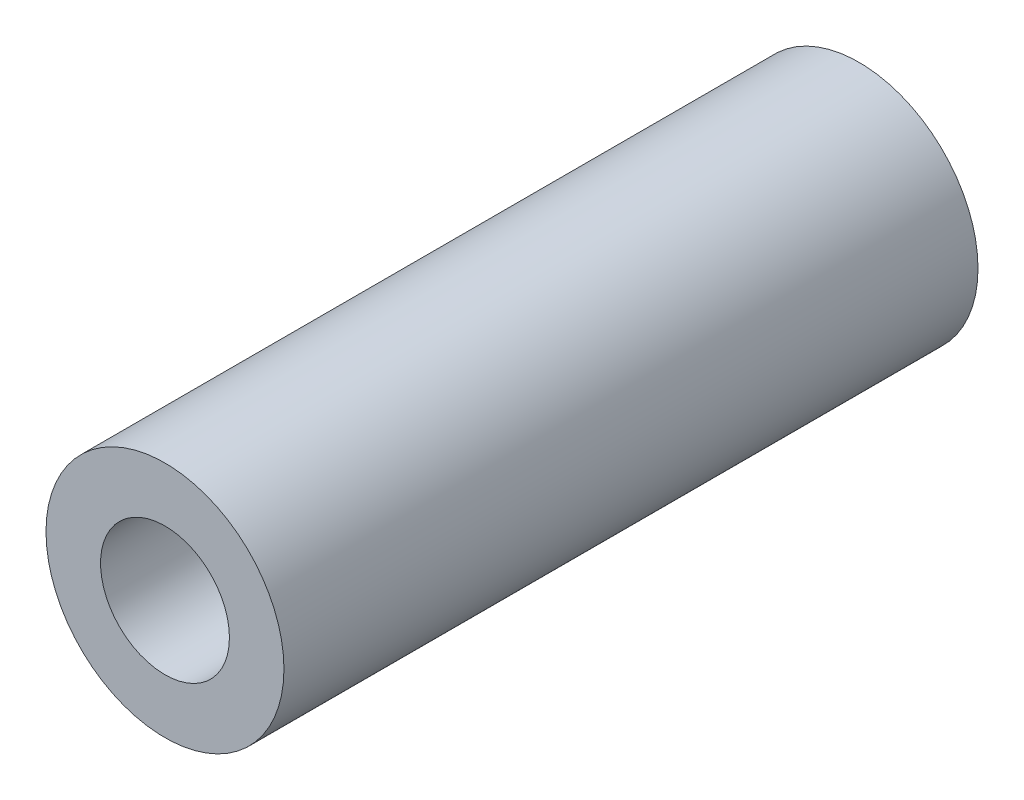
ISO-10303-21;
HEADER;
FILE_DESCRIPTION(('STEP AP214'),'2;1');
FILE_NAME('part.step','',(''),(''),'','','');
FILE_SCHEMA(('AUTOMOTIVE_DESIGN { 1 0 10303 214 1 1 1 1 }'));
ENDSEC;
DATA;
#1=APPLICATION_CONTEXT('core data for automotive mechanical design processes');
#2=APPLICATION_PROTOCOL_DEFINITION('international standard','automotive_design',2000,#1);
#3=PRODUCT_CONTEXT('',#1,'mechanical');
#4=PRODUCT('Part','Part','',(#3));
#5=PRODUCT_RELATED_PRODUCT_CATEGORY('part','',(#4));
#6=PRODUCT_DEFINITION_FORMATION('','',#4);
#7=PRODUCT_DEFINITION_CONTEXT('part definition',#1,'design');
#8=PRODUCT_DEFINITION('design','',#6,#7);
#9=PRODUCT_DEFINITION_SHAPE('','',#8);
#10=(LENGTH_UNIT() NAMED_UNIT(*) SI_UNIT(.MILLI.,.METRE.));
#11=(NAMED_UNIT(*) PLANE_ANGLE_UNIT() SI_UNIT($,.RADIAN.));
#12=(NAMED_UNIT(*) SI_UNIT($,.STERADIAN.) SOLID_ANGLE_UNIT());
#13=UNCERTAINTY_MEASURE_WITH_UNIT(LENGTH_MEASURE(1.E-05),#10,'distance_accuracy_value','');
#14=(GEOMETRIC_REPRESENTATION_CONTEXT(3) GLOBAL_UNCERTAINTY_ASSIGNED_CONTEXT((#13)) GLOBAL_UNIT_ASSIGNED_CONTEXT((#10,
#11,#12)) REPRESENTATION_CONTEXT('',''));
#15=CARTESIAN_POINT('',(0.,0.,0.));
#16=DIRECTION('',(0.,0.,1.));
#17=DIRECTION('',(1.,0.,0.));
#18=AXIS2_PLACEMENT_3D('',#15,#16,#17);
#19=CARTESIAN_POINT('',(0.,0.,35.));
#20=DIRECTION('',(0.,0.,1.));
#21=DIRECTION('',(1.,0.,0.));
#22=AXIS2_PLACEMENT_3D('',#19,#20,#21);
#23=PLANE('',#22);
#24=CARTESIAN_POINT('',(0.,0.,35.));
#25=DIRECTION('',(0.,0.,1.));
#26=DIRECTION('',(1.,0.,0.));
#27=AXIS2_PLACEMENT_3D('',#24,#25,#26);
#28=CIRCLE('',#27,6.);
#29=CARTESIAN_POINT('',(6.,0.,35.));
#30=VERTEX_POINT('',#29);
#31=EDGE_CURVE('E10',#30,#30,#28,.T.);
#32=ORIENTED_EDGE('',*,*,#31,.T.);
#33=EDGE_LOOP('',(#32));
#34=FACE_BOUND('',#33,.T.);
#35=CARTESIAN_POINT('',(0.,0.,35.));
#36=DIRECTION('',(0.,0.,1.));
#37=DIRECTION('',(1.,0.,0.));
#38=AXIS2_PLACEMENT_3D('',#35,#36,#37);
#39=CIRCLE('',#38,3.25);
#40=CARTESIAN_POINT('',(3.25,0.,35.));
#41=VERTEX_POINT('',#40);
#42=EDGE_CURVE('E39',#41,#41,#39,.T.);
#43=ORIENTED_EDGE('',*,*,#42,.F.);
#44=EDGE_LOOP('',(#43));
#45=FACE_BOUND('',#44,.T.);
#46=ADVANCED_FACE('F28',(#34,#45),#23,.T.);
#47=CARTESIAN_POINT('',(0.,0.,0.));
#48=DIRECTION('',(0.,0.,1.));
#49=DIRECTION('',(1.,0.,0.));
#50=AXIS2_PLACEMENT_3D('',#47,#48,#49);
#51=PLANE('',#50);
#52=CARTESIAN_POINT('',(0.,0.,0.));
#53=DIRECTION('',(0.,0.,1.));
#54=DIRECTION('',(1.,0.,0.));
#55=AXIS2_PLACEMENT_3D('',#52,#53,#54);
#56=CIRCLE('',#55,6.);
#57=CARTESIAN_POINT('',(6.,0.,0.));
#58=VERTEX_POINT('',#57);
#59=EDGE_CURVE('E35',#58,#58,#56,.T.);
#60=ORIENTED_EDGE('',*,*,#59,.F.);
#61=EDGE_LOOP('',(#60));
#62=FACE_BOUND('',#61,.T.);
#63=CARTESIAN_POINT('',(0.,0.,0.));
#64=DIRECTION('',(0.,0.,1.));
#65=DIRECTION('',(1.,0.,0.));
#66=AXIS2_PLACEMENT_3D('',#63,#64,#65);
#67=CIRCLE('',#66,3.25);
#68=CARTESIAN_POINT('',(3.25,0.,0.));
#69=VERTEX_POINT('',#68);
#70=EDGE_CURVE('E43',#69,#69,#67,.T.);
#71=ORIENTED_EDGE('',*,*,#70,.T.);
#72=EDGE_LOOP('',(#71));
#73=FACE_BOUND('',#72,.T.);
#74=ADVANCED_FACE('F49',(#62,#73),#51,.F.);
#75=CARTESIAN_POINT('',(0.,0.,35.));
#76=DIRECTION('',(0.,0.,-1.));
#77=DIRECTION('',(-1.,0.,0.));
#78=AXIS2_PLACEMENT_3D('',#75,#76,#77);
#79=CYLINDRICAL_SURFACE('',#78,6.);
#80=ORIENTED_EDGE('',*,*,#31,.F.);
#81=EDGE_LOOP('',(#80));
#82=FACE_BOUND('',#81,.T.);
#83=ORIENTED_EDGE('',*,*,#59,.T.);
#84=EDGE_LOOP('',(#83));
#85=FACE_BOUND('',#84,.T.);
#86=ADVANCED_FACE('F30',(#82,#85),#79,.T.);
#87=CARTESIAN_POINT('',(0.,0.,35.));
#88=DIRECTION('',(0.,0.,-1.));
#89=DIRECTION('',(-1.,0.,0.));
#90=AXIS2_PLACEMENT_3D('',#87,#88,#89);
#91=CYLINDRICAL_SURFACE('',#90,3.25);
#92=ORIENTED_EDGE('',*,*,#42,.T.);
#93=EDGE_LOOP('',(#92));
#94=FACE_BOUND('',#93,.T.);
#95=ORIENTED_EDGE('',*,*,#70,.F.);
#96=EDGE_LOOP('',(#95));
#97=FACE_BOUND('',#96,.T.);
#98=ADVANCED_FACE('F51',(#94,#97),#91,.F.);
#99=CLOSED_SHELL('',(#46,#74,#86,#98));
#100=MANIFOLD_SOLID_BREP('B2',#99);
#101=ADVANCED_BREP_SHAPE_REPRESENTATION('',(#18,#100),#14);
#102=SHAPE_DEFINITION_REPRESENTATION(#9,#101);
ENDSEC;
END-ISO-10303-21;
